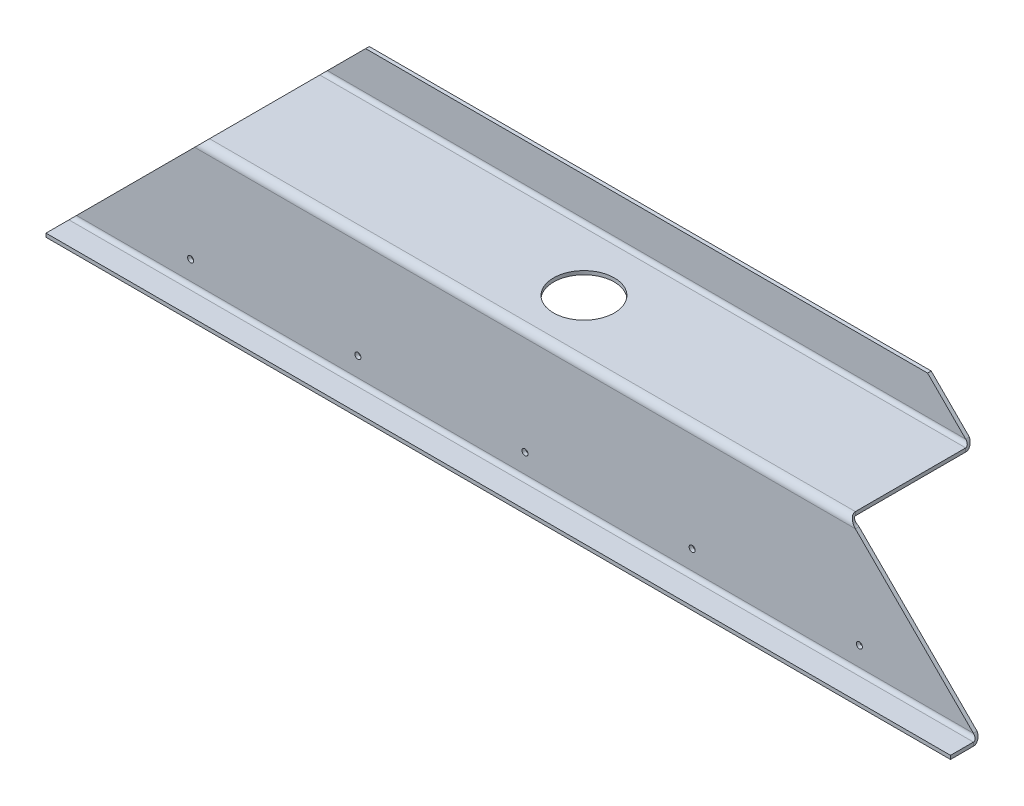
ISO-10303-21;
HEADER;
FILE_DESCRIPTION(('STEP AP214'),'2;1');
FILE_NAME('part.step','',(''),(''),'','','');
FILE_SCHEMA(('AUTOMOTIVE_DESIGN { 1 0 10303 214 1 1 1 1 }'));
ENDSEC;
DATA;
#1=APPLICATION_CONTEXT('core data for automotive mechanical design processes');
#2=APPLICATION_PROTOCOL_DEFINITION('international standard','automotive_design',2000,#1);
#3=PRODUCT_CONTEXT('',#1,'mechanical');
#4=PRODUCT('Part','Part','',(#3));
#5=PRODUCT_RELATED_PRODUCT_CATEGORY('part','',(#4));
#6=PRODUCT_DEFINITION_FORMATION('','',#4);
#7=PRODUCT_DEFINITION_CONTEXT('part definition',#1,'design');
#8=PRODUCT_DEFINITION('design','',#6,#7);
#9=PRODUCT_DEFINITION_SHAPE('','',#8);
#10=(LENGTH_UNIT() NAMED_UNIT(*) SI_UNIT(.MILLI.,.METRE.));
#11=(NAMED_UNIT(*) PLANE_ANGLE_UNIT() SI_UNIT($,.RADIAN.));
#12=(NAMED_UNIT(*) SI_UNIT($,.STERADIAN.) SOLID_ANGLE_UNIT());
#13=UNCERTAINTY_MEASURE_WITH_UNIT(LENGTH_MEASURE(1.E-05),#10,'distance_accuracy_value','');
#14=(GEOMETRIC_REPRESENTATION_CONTEXT(3) GLOBAL_UNCERTAINTY_ASSIGNED_CONTEXT((#13)) GLOBAL_UNIT_ASSIGNED_CONTEXT((#10,
#11,#12)) REPRESENTATION_CONTEXT('',''));
#15=CARTESIAN_POINT('',(0.,0.,0.));
#16=DIRECTION('',(0.,0.,1.));
#17=DIRECTION('',(1.,0.,0.));
#18=AXIS2_PLACEMENT_3D('',#15,#16,#17);
#19=CARTESIAN_POINT('',(0.,3.60016566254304E-13,104.648));
#20=DIRECTION('',(0.,0.,-1.));
#21=DIRECTION('',(0.,1.,0.));
#22=AXIS2_PLACEMENT_3D('',#19,#20,#21);
#23=PLANE('',#22);
#24=CARTESIAN_POINT('',(101.6,-85.8519999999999,104.648));
#25=DIRECTION('',(0.,0.,1.));
#26=DIRECTION('',(1.,0.,0.));
#27=AXIS2_PLACEMENT_3D('',#24,#25,#26);
#28=CIRCLE('',#27,2.54000000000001);
#29=CARTESIAN_POINT('',(104.14,-85.8519999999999,104.648));
#30=VERTEX_POINT('',#29);
#31=EDGE_CURVE('E862',#30,#30,#28,.T.);
#32=ORIENTED_EDGE('',*,*,#31,.F.);
#33=EDGE_LOOP('',(#32));
#34=FACE_BOUND('',#33,.T.);
#35=CARTESIAN_POINT('',(241.3,-85.8519999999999,104.648));
#36=DIRECTION('',(0.,0.,1.));
#37=DIRECTION('',(1.,0.,0.));
#38=AXIS2_PLACEMENT_3D('',#35,#36,#37);
#39=CIRCLE('',#38,2.54000000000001);
#40=CARTESIAN_POINT('',(243.84,-85.8519999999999,104.648));
#41=VERTEX_POINT('',#40);
#42=EDGE_CURVE('E863',#41,#41,#39,.T.);
#43=ORIENTED_EDGE('',*,*,#42,.F.);
#44=EDGE_LOOP('',(#43));
#45=FACE_BOUND('',#44,.T.);
#46=CARTESIAN_POINT('',(660.4,-85.8519999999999,104.648));
#47=DIRECTION('',(0.,0.,1.));
#48=DIRECTION('',(1.,0.,0.));
#49=AXIS2_PLACEMENT_3D('',#46,#47,#48);
#50=CIRCLE('',#49,2.54000000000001);
#51=CARTESIAN_POINT('',(662.94,-85.8519999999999,104.648));
#52=VERTEX_POINT('',#51);
#53=EDGE_CURVE('E865',#52,#52,#50,.T.);
#54=ORIENTED_EDGE('',*,*,#53,.F.);
#55=EDGE_LOOP('',(#54));
#56=FACE_BOUND('',#55,.T.);
#57=CARTESIAN_POINT('',(520.7,-85.8519999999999,104.648));
#58=DIRECTION('',(0.,0.,1.));
#59=DIRECTION('',(1.,0.,0.));
#60=AXIS2_PLACEMENT_3D('',#57,#58,#59);
#61=CIRCLE('',#60,2.54000000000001);
#62=CARTESIAN_POINT('',(523.24,-85.8519999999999,104.648));
#63=VERTEX_POINT('',#62);
#64=EDGE_CURVE('E280',#63,#63,#61,.T.);
#65=ORIENTED_EDGE('',*,*,#64,.F.);
#66=EDGE_LOOP('',(#65));
#67=FACE_BOUND('',#66,.T.);
#68=CARTESIAN_POINT('',(381.,-85.8519999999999,104.648));
#69=DIRECTION('',(0.,0.,1.));
#70=DIRECTION('',(1.,0.,0.));
#71=AXIS2_PLACEMENT_3D('',#68,#69,#70);
#72=CIRCLE('',#71,2.54000000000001);
#73=CARTESIAN_POINT('',(383.54,-85.8519999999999,104.648));
#74=VERTEX_POINT('',#73);
#75=EDGE_CURVE('E275',#74,#74,#72,.T.);
#76=ORIENTED_EDGE('',*,*,#75,.F.);
#77=EDGE_LOOP('',(#76));
#78=FACE_BOUND('',#77,.T.);
#79=DIRECTION('',(-0.707106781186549,0.707106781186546,0.));
#80=VECTOR('',#79,1.);
#81=CARTESIAN_POINT('',(326.961499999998,326.9615,104.647999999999));
#82=LINE('',#81,#80);
#83=CARTESIAN_POINT('',(755.777,-101.854,104.648));
#84=VERTEX_POINT('',#83);
#85=CARTESIAN_POINT('',(657.098,-3.17500000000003,104.648));
#86=VERTEX_POINT('',#85);
#87=EDGE_CURVE('E226',#84,#86,#82,.T.);
#88=ORIENTED_EDGE('',*,*,#87,.T.);
#89=DIRECTION('',(-1.,0.,0.));
#90=VECTOR('',#89,1.);
#91=CARTESIAN_POINT('',(762.,-3.175,104.648));
#92=LINE('',#91,#90);
#93=CARTESIAN_POINT('',(104.901999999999,-3.17500000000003,104.648));
#94=VERTEX_POINT('',#93);
#95=EDGE_CURVE('E243',#94,#86,#92,.F.);
#96=ORIENTED_EDGE('',*,*,#95,.F.);
#97=DIRECTION('',(0.707106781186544,0.707106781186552,0.));
#98=VECTOR('',#97,1.);
#99=CARTESIAN_POINT('',(54.0385000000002,-54.0384999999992,104.648));
#100=LINE('',#99,#98);
#101=CARTESIAN_POINT('',(6.22299999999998,-101.854,104.648));
#102=VERTEX_POINT('',#101);
#103=EDGE_CURVE('E356',#102,#94,#100,.T.);
#104=ORIENTED_EDGE('',*,*,#103,.F.);
#105=DIRECTION('',(1.,0.,0.));
#106=VECTOR('',#105,1.);
#107=CARTESIAN_POINT('',(762.,-101.854,104.648));
#108=LINE('',#107,#106);
#109=EDGE_CURVE('E248',#84,#102,#108,.F.);
#110=ORIENTED_EDGE('',*,*,#109,.F.);
#111=EDGE_LOOP('',(#88,#96,#104,#110));
#112=FACE_BOUND('',#111,.T.);
#113=ADVANCED_FACE('F88',(#34,#45,#56,#67,#78,#112),#23,.F.);
#114=CARTESIAN_POINT('',(0.,3.49778738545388E-13,101.6));
#115=DIRECTION('',(0.,0.,-1.));
#116=DIRECTION('',(0.,1.,0.));
#117=AXIS2_PLACEMENT_3D('',#114,#115,#116);
#118=PLANE('',#117);
#119=CARTESIAN_POINT('',(101.6,-85.8519999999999,101.6));
#120=DIRECTION('',(0.,0.,-1.));
#121=DIRECTION('',(0.,1.,0.));
#122=AXIS2_PLACEMENT_3D('',#119,#120,#121);
#123=CIRCLE('',#122,2.54000000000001);
#124=CARTESIAN_POINT('',(101.6,-83.3119999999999,101.6));
#125=VERTEX_POINT('',#124);
#126=EDGE_CURVE('E92',#125,#125,#123,.T.);
#127=ORIENTED_EDGE('',*,*,#126,.F.);
#128=EDGE_LOOP('',(#127));
#129=FACE_BOUND('',#128,.T.);
#130=CARTESIAN_POINT('',(241.3,-85.8519999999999,101.6));
#131=DIRECTION('',(0.,0.,-1.));
#132=DIRECTION('',(0.,1.,0.));
#133=AXIS2_PLACEMENT_3D('',#130,#131,#132);
#134=CIRCLE('',#133,2.54000000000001);
#135=CARTESIAN_POINT('',(241.3,-83.3119999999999,101.6));
#136=VERTEX_POINT('',#135);
#137=EDGE_CURVE('E282',#136,#136,#134,.T.);
#138=ORIENTED_EDGE('',*,*,#137,.F.);
#139=EDGE_LOOP('',(#138));
#140=FACE_BOUND('',#139,.T.);
#141=CARTESIAN_POINT('',(660.4,-85.8519999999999,101.6));
#142=DIRECTION('',(0.,0.,-1.));
#143=DIRECTION('',(0.,1.,0.));
#144=AXIS2_PLACEMENT_3D('',#141,#142,#143);
#145=CIRCLE('',#144,2.54000000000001);
#146=CARTESIAN_POINT('',(660.4,-83.3119999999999,101.6));
#147=VERTEX_POINT('',#146);
#148=EDGE_CURVE('E279',#147,#147,#145,.T.);
#149=ORIENTED_EDGE('',*,*,#148,.F.);
#150=EDGE_LOOP('',(#149));
#151=FACE_BOUND('',#150,.T.);
#152=CARTESIAN_POINT('',(520.7,-85.8519999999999,101.6));
#153=DIRECTION('',(0.,0.,-1.));
#154=DIRECTION('',(0.,1.,0.));
#155=AXIS2_PLACEMENT_3D('',#152,#153,#154);
#156=CIRCLE('',#155,2.54000000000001);
#157=CARTESIAN_POINT('',(520.7,-83.3119999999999,101.6));
#158=VERTEX_POINT('',#157);
#159=EDGE_CURVE('E276',#158,#158,#156,.T.);
#160=ORIENTED_EDGE('',*,*,#159,.F.);
#161=EDGE_LOOP('',(#160));
#162=FACE_BOUND('',#161,.T.);
#163=CARTESIAN_POINT('',(381.,-85.8519999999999,101.6));
#164=DIRECTION('',(0.,0.,-1.));
#165=DIRECTION('',(0.,1.,0.));
#166=AXIS2_PLACEMENT_3D('',#163,#164,#165);
#167=CIRCLE('',#166,2.54000000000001);
#168=CARTESIAN_POINT('',(381.,-83.3119999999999,101.6));
#169=VERTEX_POINT('',#168);
#170=EDGE_CURVE('E271',#169,#169,#167,.T.);
#171=ORIENTED_EDGE('',*,*,#170,.F.);
#172=EDGE_LOOP('',(#171));
#173=FACE_BOUND('',#172,.T.);
#174=DIRECTION('',(-1.,0.,0.));
#175=VECTOR('',#174,1.);
#176=CARTESIAN_POINT('',(762.,-3.175,101.6));
#177=LINE('',#176,#175);
#178=CARTESIAN_POINT('',(657.098,-3.17500000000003,101.6));
#179=VERTEX_POINT('',#178);
#180=CARTESIAN_POINT('',(104.901999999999,-3.17500000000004,101.6));
#181=VERTEX_POINT('',#180);
#182=EDGE_CURVE('E233',#179,#181,#177,.T.);
#183=ORIENTED_EDGE('',*,*,#182,.F.);
#184=DIRECTION('',(-0.707106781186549,0.707106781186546,0.));
#185=VECTOR('',#184,1.);
#186=CARTESIAN_POINT('',(326.961499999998,326.9615,101.599999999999));
#187=LINE('',#186,#185);
#188=CARTESIAN_POINT('',(755.777,-101.854,101.6));
#189=VERTEX_POINT('',#188);
#190=EDGE_CURVE('E219',#189,#179,#187,.T.);
#191=ORIENTED_EDGE('',*,*,#190,.F.);
#192=DIRECTION('',(1.,0.,0.));
#193=VECTOR('',#192,1.);
#194=CARTESIAN_POINT('',(762.,-101.854,101.6));
#195=LINE('',#194,#193);
#196=CARTESIAN_POINT('',(6.22299999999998,-101.854,101.6));
#197=VERTEX_POINT('',#196);
#198=EDGE_CURVE('E244',#189,#197,#195,.F.);
#199=ORIENTED_EDGE('',*,*,#198,.T.);
#200=DIRECTION('',(0.707106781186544,0.707106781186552,0.));
#201=VECTOR('',#200,1.);
#202=CARTESIAN_POINT('',(54.0385000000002,-54.0384999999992,101.6));
#203=LINE('',#202,#201);
#204=EDGE_CURVE('E242',#197,#181,#203,.T.);
#205=ORIENTED_EDGE('',*,*,#204,.T.);
#206=EDGE_LOOP('',(#183,#191,#199,#205));
#207=FACE_BOUND('',#206,.T.);
#208=ADVANCED_FACE('F240',(#129,#140,#151,#162,#173,#207),#118,.T.);
#209=CARTESIAN_POINT('',(873.36792134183,3.048,0.));
#210=DIRECTION('',(0.,-1.,0.));
#211=DIRECTION('',(0.,0.,-1.));
#212=AXIS2_PLACEMENT_3D('',#209,#210,#211);
#213=PLANE('',#212);
#214=CARTESIAN_POINT('',(381.,3.048,55.372));
#215=DIRECTION('',(0.,-1.,0.));
#216=DIRECTION('',(0.,0.,-1.));
#217=AXIS2_PLACEMENT_3D('',#214,#215,#216);
#218=CIRCLE('',#217,25.4);
#219=CARTESIAN_POINT('',(381.,3.048,29.972));
#220=VERTEX_POINT('',#219);
#221=EDGE_CURVE('E259',#220,#220,#218,.T.);
#222=ORIENTED_EDGE('',*,*,#221,.T.);
#223=EDGE_LOOP('',(#222));
#224=FACE_BOUND('',#223,.T.);
#225=DIRECTION('',(0.,0.,-1.));
#226=VECTOR('',#225,1.);
#227=CARTESIAN_POINT('',(650.875,3.048,0.));
#228=LINE('',#227,#226);
#229=CARTESIAN_POINT('',(650.875,3.04799999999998,98.425));
#230=VERTEX_POINT('',#229);
#231=CARTESIAN_POINT('',(650.875,3.048,6.223));
#232=VERTEX_POINT('',#231);
#233=EDGE_CURVE('E215',#230,#232,#228,.T.);
#234=ORIENTED_EDGE('',*,*,#233,.T.);
#235=DIRECTION('',(-1.,0.,0.));
#236=VECTOR('',#235,1.);
#237=CARTESIAN_POINT('',(873.36792134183,3.048,6.223));
#238=LINE('',#237,#236);
#239=CARTESIAN_POINT('',(111.124999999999,3.048,6.223));
#240=VERTEX_POINT('',#239);
#241=EDGE_CURVE('E262',#232,#240,#238,.T.);
#242=ORIENTED_EDGE('',*,*,#241,.T.);
#243=DIRECTION('',(0.,0.,-1.));
#244=VECTOR('',#243,1.);
#245=CARTESIAN_POINT('',(111.124999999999,3.048,-1.00679860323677E-13));
#246=LINE('',#245,#244);
#247=CARTESIAN_POINT('',(111.124999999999,3.04799999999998,98.425));
#248=VERTEX_POINT('',#247);
#249=EDGE_CURVE('E367',#248,#240,#246,.T.);
#250=ORIENTED_EDGE('',*,*,#249,.F.);
#251=DIRECTION('',(-1.,0.,0.));
#252=VECTOR('',#251,1.);
#253=CARTESIAN_POINT('',(0.,3.04799999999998,98.425));
#254=LINE('',#253,#252);
#255=EDGE_CURVE('E252',#248,#230,#254,.F.);
#256=ORIENTED_EDGE('',*,*,#255,.T.);
#257=EDGE_LOOP('',(#234,#242,#250,#256));
#258=FACE_BOUND('',#257,.T.);
#259=ADVANCED_FACE('F90',(#224,#258),#213,.F.);
#260=CARTESIAN_POINT('',(873.36792134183,0.,0.));
#261=DIRECTION('',(0.,-1.,0.));
#262=DIRECTION('',(0.,0.,-1.));
#263=AXIS2_PLACEMENT_3D('',#260,#261,#262);
#264=PLANE('',#263);
#265=CARTESIAN_POINT('',(381.,0.,55.372));
#266=DIRECTION('',(0.,-1.,0.));
#267=DIRECTION('',(0.,0.,-1.));
#268=AXIS2_PLACEMENT_3D('',#265,#266,#267);
#269=CIRCLE('',#268,25.4);
#270=CARTESIAN_POINT('',(381.,0.,29.972));
#271=VERTEX_POINT('',#270);
#272=EDGE_CURVE('E255',#271,#271,#269,.T.);
#273=ORIENTED_EDGE('',*,*,#272,.F.);
#274=EDGE_LOOP('',(#273));
#275=FACE_BOUND('',#274,.T.);
#276=DIRECTION('',(-1.,0.,0.));
#277=VECTOR('',#276,1.);
#278=CARTESIAN_POINT('',(873.36792134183,0.,6.223));
#279=LINE('',#278,#277);
#280=CARTESIAN_POINT('',(650.875,0.,6.223));
#281=VERTEX_POINT('',#280);
#282=CARTESIAN_POINT('',(111.124999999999,0.,6.223));
#283=VERTEX_POINT('',#282);
#284=EDGE_CURVE('E13',#281,#283,#279,.T.);
#285=ORIENTED_EDGE('',*,*,#284,.F.);
#286=DIRECTION('',(0.,0.,-1.));
#287=VECTOR('',#286,1.);
#288=CARTESIAN_POINT('',(650.875,0.,0.));
#289=LINE('',#288,#287);
#290=CARTESIAN_POINT('',(650.875,0.,98.425));
#291=VERTEX_POINT('',#290);
#292=EDGE_CURVE('E325',#291,#281,#289,.T.);
#293=ORIENTED_EDGE('',*,*,#292,.F.);
#294=DIRECTION('',(-1.,0.,0.));
#295=VECTOR('',#294,1.);
#296=CARTESIAN_POINT('',(0.,0.,98.425));
#297=LINE('',#296,#295);
#298=CARTESIAN_POINT('',(111.124999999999,0.,98.425));
#299=VERTEX_POINT('',#298);
#300=EDGE_CURVE('E236',#299,#291,#297,.F.);
#301=ORIENTED_EDGE('',*,*,#300,.F.);
#302=DIRECTION('',(0.,0.,-1.));
#303=VECTOR('',#302,1.);
#304=CARTESIAN_POINT('',(111.124999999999,0.,0.));
#305=LINE('',#304,#303);
#306=EDGE_CURVE('E363',#299,#283,#305,.T.);
#307=ORIENTED_EDGE('',*,*,#306,.T.);
#308=EDGE_LOOP('',(#285,#293,#301,#307));
#309=FACE_BOUND('',#308,.T.);
#310=ADVANCED_FACE('F460',(#275,#309),#264,.T.);
#311=CARTESIAN_POINT('',(873.36792134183,6.223,6.223));
#312=DIRECTION('',(-1.,0.,0.));
#313=DIRECTION('',(0.,0.,1.));
#314=AXIS2_PLACEMENT_3D('',#311,#312,#313);
#315=CYLINDRICAL_SURFACE('',#314,6.223);
#316=DIRECTION('',(-1.,0.,0.));
#317=VECTOR('',#316,1.);
#318=CARTESIAN_POINT('',(873.36792134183,6.22299999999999,0.));
#319=LINE('',#318,#317);
#320=CARTESIAN_POINT('',(647.7,6.22299999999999,0.));
#321=VERTEX_POINT('',#320);
#322=CARTESIAN_POINT('',(114.299999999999,6.22299999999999,0.));
#323=VERTEX_POINT('',#322);
#324=EDGE_CURVE('E97',#321,#323,#319,.T.);
#325=ORIENTED_EDGE('',*,*,#324,.F.);
#326=CARTESIAN_POINT('',(647.7,6.223,6.223));
#327=DIRECTION('',(-0.890761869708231,-0.454470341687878,0.));
#328=DIRECTION('',(-0.454470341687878,0.890761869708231,0.));
#329=AXIS2_PLACEMENT_3D('',#326,#327,#328);
#330=ELLIPSE('',#329,6.98615445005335,6.223);
#331=EDGE_CURVE('E311',#281,#321,#330,.F.);
#332=ORIENTED_EDGE('',*,*,#331,.F.);
#333=ORIENTED_EDGE('',*,*,#284,.T.);
#334=CARTESIAN_POINT('',(114.299999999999,6.223,6.223));
#335=DIRECTION('',(-0.890761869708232,0.454470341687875,0.));
#336=DIRECTION('',(-0.454470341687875,-0.890761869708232,0.));
#337=AXIS2_PLACEMENT_3D('',#334,#335,#336);
#338=ELLIPSE('',#337,6.98615445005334,6.223);
#339=EDGE_CURVE('E352',#283,#323,#338,.F.);
#340=ORIENTED_EDGE('',*,*,#339,.T.);
#341=EDGE_LOOP('',(#325,#332,#333,#340));
#342=FACE_BOUND('',#341,.T.);
#343=ADVANCED_FACE('F455',(#342),#315,.T.);
#344=CARTESIAN_POINT('',(873.36792134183,0.,0.));
#345=DIRECTION('',(0.,0.,-1.));
#346=DIRECTION('',(-1.,0.,0.));
#347=AXIS2_PLACEMENT_3D('',#344,#345,#346);
#348=PLANE('',#347);
#349=DIRECTION('',(-1.,0.,0.));
#350=VECTOR('',#349,1.);
#351=CARTESIAN_POINT('',(873.36792134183,38.1,0.));
#352=LINE('',#351,#350);
#353=CARTESIAN_POINT('',(615.822999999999,38.1,0.));
#354=VERTEX_POINT('',#353);
#355=CARTESIAN_POINT('',(146.176999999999,38.1,0.));
#356=VERTEX_POINT('',#355);
#357=EDGE_CURVE('E268',#354,#356,#352,.T.);
#358=ORIENTED_EDGE('',*,*,#357,.F.);
#359=DIRECTION('',(-0.707106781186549,0.707106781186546,0.));
#360=VECTOR('',#359,1.);
#361=CARTESIAN_POINT('',(763.645460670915,-109.722460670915,0.));
#362=LINE('',#361,#360);
#363=EDGE_CURVE('E316',#321,#354,#362,.T.);
#364=ORIENTED_EDGE('',*,*,#363,.F.);
#365=ORIENTED_EDGE('',*,*,#324,.T.);
#366=DIRECTION('',(0.707106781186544,0.707106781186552,0.));
#367=VECTOR('',#366,1.);
#368=CARTESIAN_POINT('',(490.72246067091,382.645460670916,0.));
#369=LINE('',#368,#367);
#370=EDGE_CURVE('E374',#323,#356,#369,.T.);
#371=ORIENTED_EDGE('',*,*,#370,.T.);
#372=EDGE_LOOP('',(#358,#364,#365,#371));
#373=FACE_BOUND('',#372,.T.);
#374=ADVANCED_FACE('F452',(#373),#348,.T.);
#375=CARTESIAN_POINT('',(873.36792134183,38.1,3.048));
#376=DIRECTION('',(0.,1.,0.));
#377=DIRECTION('',(0.,0.,1.));
#378=AXIS2_PLACEMENT_3D('',#375,#376,#377);
#379=PLANE('',#378);
#380=DIRECTION('',(-1.,0.,0.));
#381=VECTOR('',#380,1.);
#382=CARTESIAN_POINT('',(873.36792134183,38.1,3.048));
#383=LINE('',#382,#381);
#384=CARTESIAN_POINT('',(615.822999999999,38.1,3.04799999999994));
#385=VERTEX_POINT('',#384);
#386=CARTESIAN_POINT('',(146.176999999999,38.1,3.048));
#387=VERTEX_POINT('',#386);
#388=EDGE_CURVE('E266',#385,#387,#383,.T.);
#389=ORIENTED_EDGE('',*,*,#388,.F.);
#390=DIRECTION('',(0.,0.,1.));
#391=VECTOR('',#390,1.);
#392=CARTESIAN_POINT('',(615.822999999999,38.1,3.04799999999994));
#393=LINE('',#392,#391);
#394=EDGE_CURVE('E307',#385,#354,#393,.F.);
#395=ORIENTED_EDGE('',*,*,#394,.T.);
#396=ORIENTED_EDGE('',*,*,#357,.T.);
#397=DIRECTION('',(0.,0.,-1.));
#398=VECTOR('',#397,1.);
#399=CARTESIAN_POINT('',(146.176999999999,38.1,0.));
#400=LINE('',#399,#398);
#401=EDGE_CURVE('E391',#356,#387,#400,.F.);
#402=ORIENTED_EDGE('',*,*,#401,.T.);
#403=EDGE_LOOP('',(#389,#395,#396,#402));
#404=FACE_BOUND('',#403,.T.);
#405=ADVANCED_FACE('F448',(#404),#379,.T.);
#406=CARTESIAN_POINT('',(873.36792134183,0.,3.048));
#407=DIRECTION('',(0.,0.,-1.));
#408=DIRECTION('',(-1.,0.,0.));
#409=AXIS2_PLACEMENT_3D('',#406,#407,#408);
#410=PLANE('',#409);
#411=DIRECTION('',(-0.707106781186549,0.707106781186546,0.));
#412=VECTOR('',#411,1.);
#413=CARTESIAN_POINT('',(763.645460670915,-109.722460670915,3.048));
#414=LINE('',#413,#412);
#415=CARTESIAN_POINT('',(647.7,6.22299999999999,3.048));
#416=VERTEX_POINT('',#415);
#417=EDGE_CURVE('E313',#416,#385,#414,.T.);
#418=ORIENTED_EDGE('',*,*,#417,.T.);
#419=ORIENTED_EDGE('',*,*,#388,.T.);
#420=DIRECTION('',(0.707106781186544,0.707106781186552,0.));
#421=VECTOR('',#420,1.);
#422=CARTESIAN_POINT('',(490.72246067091,382.645460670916,3.048));
#423=LINE('',#422,#421);
#424=CARTESIAN_POINT('',(114.299999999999,6.22299999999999,3.048));
#425=VERTEX_POINT('',#424);
#426=EDGE_CURVE('E385',#425,#387,#423,.T.);
#427=ORIENTED_EDGE('',*,*,#426,.F.);
#428=DIRECTION('',(-1.,0.,0.));
#429=VECTOR('',#428,1.);
#430=CARTESIAN_POINT('',(873.36792134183,6.22299999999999,3.048));
#431=LINE('',#430,#429);
#432=EDGE_CURVE('E264',#416,#425,#431,.T.);
#433=ORIENTED_EDGE('',*,*,#432,.F.);
#434=EDGE_LOOP('',(#418,#419,#427,#433));
#435=FACE_BOUND('',#434,.T.);
#436=ADVANCED_FACE('F440',(#435),#410,.F.);
#437=CARTESIAN_POINT('',(873.36792134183,6.223,6.223));
#438=DIRECTION('',(-1.,0.,0.));
#439=DIRECTION('',(0.,0.,1.));
#440=AXIS2_PLACEMENT_3D('',#437,#438,#439);
#441=CYLINDRICAL_SURFACE('',#440,3.175);
#442=CARTESIAN_POINT('',(647.7,6.223,6.223));
#443=DIRECTION('',(-0.707106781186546,-0.707106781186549,0.));
#444=DIRECTION('',(-0.707106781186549,0.707106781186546,0.));
#445=AXIS2_PLACEMENT_3D('',#442,#443,#444);
#446=ELLIPSE('',#445,4.49012806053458,3.175);
#447=EDGE_CURVE('E237',#232,#416,#446,.F.);
#448=ORIENTED_EDGE('',*,*,#447,.T.);
#449=ORIENTED_EDGE('',*,*,#432,.T.);
#450=CARTESIAN_POINT('',(114.299999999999,6.223,6.223));
#451=DIRECTION('',(-0.707106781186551,0.707106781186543,0.));
#452=DIRECTION('',(-0.707106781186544,-0.707106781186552,0.));
#453=AXIS2_PLACEMENT_3D('',#450,#451,#452);
#454=ELLIPSE('',#453,4.49012806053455,3.175);
#455=EDGE_CURVE('E337',#240,#425,#454,.F.);
#456=ORIENTED_EDGE('',*,*,#455,.F.);
#457=ORIENTED_EDGE('',*,*,#241,.F.);
#458=EDGE_LOOP('',(#448,#449,#456,#457));
#459=FACE_BOUND('',#458,.T.);
#460=ADVANCED_FACE('F436',(#459),#441,.F.);
#461=CARTESIAN_POINT('',(0.,-3.17500000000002,98.425));
#462=DIRECTION('',(-1.,0.,0.));
#463=DIRECTION('',(0.,0.,1.));
#464=AXIS2_PLACEMENT_3D('',#461,#462,#463);
#465=CYLINDRICAL_SURFACE('',#464,6.223);
#466=ORIENTED_EDGE('',*,*,#95,.T.);
#467=CARTESIAN_POINT('',(657.098,-3.17500000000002,98.425));
#468=DIRECTION('',(-0.707106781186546,-0.707106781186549,0.));
#469=DIRECTION('',(-0.707106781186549,0.707106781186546,0.));
#470=AXIS2_PLACEMENT_3D('',#467,#468,#469);
#471=ELLIPSE('',#470,8.80065099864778,6.223);
#472=EDGE_CURVE('E212',#230,#86,#471,.F.);
#473=ORIENTED_EDGE('',*,*,#472,.F.);
#474=ORIENTED_EDGE('',*,*,#255,.F.);
#475=CARTESIAN_POINT('',(104.901999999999,-3.17500000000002,98.425));
#476=DIRECTION('',(-0.707106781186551,0.707106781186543,0.));
#477=DIRECTION('',(-0.707106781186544,-0.707106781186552,0.));
#478=AXIS2_PLACEMENT_3D('',#475,#476,#477);
#479=ELLIPSE('',#478,8.80065099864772,6.223);
#480=EDGE_CURVE('E338',#248,#94,#479,.F.);
#481=ORIENTED_EDGE('',*,*,#480,.T.);
#482=EDGE_LOOP('',(#466,#473,#474,#481));
#483=FACE_BOUND('',#482,.T.);
#484=ADVANCED_FACE('F419',(#483),#465,.T.);
#485=CARTESIAN_POINT('',(0.,-3.17500000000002,98.425));
#486=DIRECTION('',(-1.,0.,0.));
#487=DIRECTION('',(0.,0.,1.));
#488=AXIS2_PLACEMENT_3D('',#485,#486,#487);
#489=CYLINDRICAL_SURFACE('',#488,3.175);
#490=CARTESIAN_POINT('',(657.098,-3.17500000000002,98.425));
#491=DIRECTION('',(-0.454470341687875,-0.890761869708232,0.));
#492=DIRECTION('',(-0.890761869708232,0.454470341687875,0.));
#493=AXIS2_PLACEMENT_3D('',#490,#491,#492);
#494=ELLIPSE('',#493,6.98615445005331,3.175);
#495=EDGE_CURVE('E209',#291,#179,#494,.F.);
#496=ORIENTED_EDGE('',*,*,#495,.T.);
#497=ORIENTED_EDGE('',*,*,#182,.T.);
#498=CARTESIAN_POINT('',(104.901999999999,-3.17500000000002,98.425));
#499=DIRECTION('',(-0.454470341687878,0.890761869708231,0.));
#500=DIRECTION('',(-0.890761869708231,-0.454470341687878,0.));
#501=AXIS2_PLACEMENT_3D('',#498,#499,#500);
#502=ELLIPSE('',#501,6.98615445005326,3.175);
#503=EDGE_CURVE('E335',#299,#181,#502,.F.);
#504=ORIENTED_EDGE('',*,*,#503,.F.);
#505=ORIENTED_EDGE('',*,*,#300,.T.);
#506=EDGE_LOOP('',(#496,#497,#504,#505));
#507=FACE_BOUND('',#506,.T.);
#508=ADVANCED_FACE('F231',(#507),#489,.F.);
#509=CARTESIAN_POINT('',(762.,-101.854,107.823));
#510=DIRECTION('',(1.,0.,0.));
#511=DIRECTION('',(0.,-1.,0.));
#512=AXIS2_PLACEMENT_3D('',#509,#510,#511);
#513=CYLINDRICAL_SURFACE('',#512,6.223);
#514=ORIENTED_EDGE('',*,*,#198,.F.);
#515=CARTESIAN_POINT('',(755.777,-101.854,107.823));
#516=DIRECTION('',(-0.890761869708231,-0.454470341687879,0.));
#517=DIRECTION('',(0.454470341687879,-0.890761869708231,0.));
#518=AXIS2_PLACEMENT_3D('',#515,#516,#517);
#519=ELLIPSE('',#518,6.98615445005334,6.223);
#520=CARTESIAN_POINT('',(758.952,-108.077,107.823));
#521=VERTEX_POINT('',#520);
#522=EDGE_CURVE('E297',#521,#189,#519,.F.);
#523=ORIENTED_EDGE('',*,*,#522,.F.);
#524=DIRECTION('',(1.,0.,0.));
#525=VECTOR('',#524,1.);
#526=CARTESIAN_POINT('',(0.,-108.077,107.823));
#527=LINE('',#526,#525);
#528=CARTESIAN_POINT('',(3.04799999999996,-108.077,107.823));
#529=VERTEX_POINT('',#528);
#530=EDGE_CURVE('E400',#521,#529,#527,.F.);
#531=ORIENTED_EDGE('',*,*,#530,.T.);
#532=CARTESIAN_POINT('',(6.22299999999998,-101.854,107.823));
#533=DIRECTION('',(-0.890761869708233,0.454470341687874,0.));
#534=DIRECTION('',(0.454470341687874,0.890761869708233,0.));
#535=AXIS2_PLACEMENT_3D('',#532,#533,#534);
#536=ELLIPSE('',#535,6.98615445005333,6.223);
#537=EDGE_CURVE('E341',#529,#197,#536,.F.);
#538=ORIENTED_EDGE('',*,*,#537,.T.);
#539=EDGE_LOOP('',(#514,#523,#531,#538));
#540=FACE_BOUND('',#539,.T.);
#541=ADVANCED_FACE('F496',(#540),#513,.T.);
#542=CARTESIAN_POINT('',(762.,-101.854,107.823));
#543=DIRECTION('',(1.,0.,0.));
#544=DIRECTION('',(0.,-1.,0.));
#545=AXIS2_PLACEMENT_3D('',#542,#543,#544);
#546=CYLINDRICAL_SURFACE('',#545,3.175);
#547=CARTESIAN_POINT('',(755.777,-101.854,107.823));
#548=DIRECTION('',(-0.707106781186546,-0.707106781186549,0.));
#549=DIRECTION('',(0.707106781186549,-0.707106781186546,0.));
#550=AXIS2_PLACEMENT_3D('',#547,#548,#549);
#551=ELLIPSE('',#550,4.49012806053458,3.175);
#552=CARTESIAN_POINT('',(758.952,-105.029,107.823));
#553=VERTEX_POINT('',#552);
#554=EDGE_CURVE('E274',#553,#84,#551,.F.);
#555=ORIENTED_EDGE('',*,*,#554,.T.);
#556=ORIENTED_EDGE('',*,*,#109,.T.);
#557=CARTESIAN_POINT('',(6.22299999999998,-101.854,107.823));
#558=DIRECTION('',(-0.707106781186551,0.707106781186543,0.));
#559=DIRECTION('',(0.707106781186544,0.707106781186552,0.));
#560=AXIS2_PLACEMENT_3D('',#557,#558,#559);
#561=ELLIPSE('',#560,4.49012806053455,3.175);
#562=CARTESIAN_POINT('',(3.04799999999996,-105.029,107.823));
#563=VERTEX_POINT('',#562);
#564=EDGE_CURVE('E333',#563,#102,#561,.F.);
#565=ORIENTED_EDGE('',*,*,#564,.F.);
#566=DIRECTION('',(1.,0.,0.));
#567=VECTOR('',#566,1.);
#568=CARTESIAN_POINT('',(0.,-105.029,107.823));
#569=LINE('',#568,#567);
#570=EDGE_CURVE('E394',#563,#553,#569,.T.);
#571=ORIENTED_EDGE('',*,*,#570,.T.);
#572=EDGE_LOOP('',(#555,#556,#565,#571));
#573=FACE_BOUND('',#572,.T.);
#574=ADVANCED_FACE('F406',(#573),#546,.F.);
#575=CARTESIAN_POINT('',(0.,-108.077,0.));
#576=DIRECTION('',(0.,1.,0.));
#577=DIRECTION('',(0.,0.,1.));
#578=AXIS2_PLACEMENT_3D('',#575,#576,#577);
#579=PLANE('',#578);
#580=DIRECTION('',(0.,0.,1.));
#581=VECTOR('',#580,1.);
#582=CARTESIAN_POINT('',(758.952,-108.077,0.));
#583=LINE('',#582,#581);
#584=CARTESIAN_POINT('',(758.952,-108.077,127.));
#585=VERTEX_POINT('',#584);
#586=EDGE_CURVE('E303',#521,#585,#583,.T.);
#587=ORIENTED_EDGE('',*,*,#586,.T.);
#588=DIRECTION('',(-1.,0.,0.));
#589=VECTOR('',#588,1.);
#590=CARTESIAN_POINT('',(0.,-108.077,127.));
#591=LINE('',#590,#589);
#592=CARTESIAN_POINT('',(3.04799999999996,-108.077,127.));
#593=VERTEX_POINT('',#592);
#594=EDGE_CURVE('E113',#585,#593,#591,.T.);
#595=ORIENTED_EDGE('',*,*,#594,.T.);
#596=DIRECTION('',(0.,0.,1.));
#597=VECTOR('',#596,1.);
#598=CARTESIAN_POINT('',(3.04799999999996,-108.077,0.));
#599=LINE('',#598,#597);
#600=EDGE_CURVE('E346',#529,#593,#599,.T.);
#601=ORIENTED_EDGE('',*,*,#600,.F.);
#602=ORIENTED_EDGE('',*,*,#530,.F.);
#603=EDGE_LOOP('',(#587,#595,#601,#602));
#604=FACE_BOUND('',#603,.T.);
#605=ADVANCED_FACE('F622',(#604),#579,.F.);
#606=CARTESIAN_POINT('',(0.,-105.029,0.));
#607=DIRECTION('',(0.,1.,0.));
#608=DIRECTION('',(0.,0.,1.));
#609=AXIS2_PLACEMENT_3D('',#606,#607,#608);
#610=PLANE('',#609);
#611=DIRECTION('',(1.,0.,0.));
#612=VECTOR('',#611,1.);
#613=CARTESIAN_POINT('',(0.,-105.029,127.));
#614=LINE('',#613,#612);
#615=CARTESIAN_POINT('',(758.952,-105.029,127.));
#616=VERTEX_POINT('',#615);
#617=CARTESIAN_POINT('',(3.04799999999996,-105.029,127.));
#618=VERTEX_POINT('',#617);
#619=EDGE_CURVE('E398',#616,#618,#614,.F.);
#620=ORIENTED_EDGE('',*,*,#619,.F.);
#621=DIRECTION('',(0.,0.,1.));
#622=VECTOR('',#621,1.);
#623=CARTESIAN_POINT('',(758.952,-105.029,0.));
#624=LINE('',#623,#622);
#625=EDGE_CURVE('E105',#553,#616,#624,.T.);
#626=ORIENTED_EDGE('',*,*,#625,.F.);
#627=ORIENTED_EDGE('',*,*,#570,.F.);
#628=DIRECTION('',(0.,0.,1.));
#629=VECTOR('',#628,1.);
#630=CARTESIAN_POINT('',(3.04799999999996,-105.029,0.));
#631=LINE('',#630,#629);
#632=EDGE_CURVE('E349',#563,#618,#631,.T.);
#633=ORIENTED_EDGE('',*,*,#632,.T.);
#634=EDGE_LOOP('',(#620,#626,#627,#633));
#635=FACE_BOUND('',#634,.T.);
#636=ADVANCED_FACE('F611',(#635),#610,.T.);
#637=CARTESIAN_POINT('',(0.,-108.077,127.));
#638=DIRECTION('',(0.,0.,-1.));
#639=DIRECTION('',(0.,1.,0.));
#640=AXIS2_PLACEMENT_3D('',#637,#638,#639);
#641=PLANE('',#640);
#642=DIRECTION('',(0.,1.,0.));
#643=VECTOR('',#642,1.);
#644=CARTESIAN_POINT('',(758.952,-105.029,127.));
#645=LINE('',#644,#643);
#646=EDGE_CURVE('E227',#616,#585,#645,.F.);
#647=ORIENTED_EDGE('',*,*,#646,.F.);
#648=ORIENTED_EDGE('',*,*,#619,.T.);
#649=DIRECTION('',(0.,1.,0.));
#650=VECTOR('',#649,1.);
#651=CARTESIAN_POINT('',(3.04799999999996,-105.029,127.));
#652=LINE('',#651,#650);
#653=EDGE_CURVE('E353',#618,#593,#652,.F.);
#654=ORIENTED_EDGE('',*,*,#653,.T.);
#655=ORIENTED_EDGE('',*,*,#594,.F.);
#656=EDGE_LOOP('',(#647,#648,#654,#655));
#657=FACE_BOUND('',#656,.T.);
#658=ADVANCED_FACE('F500',(#657),#641,.F.);
#659=CARTESIAN_POINT('',(381.,38.1,55.372));
#660=DIRECTION('',(0.,-1.,0.));
#661=DIRECTION('',(0.,0.,-1.));
#662=AXIS2_PLACEMENT_3D('',#659,#660,#661);
#663=CYLINDRICAL_SURFACE('',#662,25.4);
#664=ORIENTED_EDGE('',*,*,#272,.T.);
#665=EDGE_LOOP('',(#664));
#666=FACE_BOUND('',#665,.T.);
#667=ORIENTED_EDGE('',*,*,#221,.F.);
#668=EDGE_LOOP('',(#667));
#669=FACE_BOUND('',#668,.T.);
#670=ADVANCED_FACE('F497',(#666,#669),#663,.F.);
#671=CARTESIAN_POINT('',(490.72246067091,382.645460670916,0.));
#672=DIRECTION('',(-0.707106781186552,0.707106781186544,0.));
#673=DIRECTION('',(0.707106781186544,0.707106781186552,0.));
#674=AXIS2_PLACEMENT_3D('',#671,#672,#673);
#675=PLANE('',#674);
#676=ORIENTED_EDGE('',*,*,#401,.F.);
#677=ORIENTED_EDGE('',*,*,#370,.F.);
#678=DIRECTION('',(0.,0.,-1.));
#679=VECTOR('',#678,1.);
#680=CARTESIAN_POINT('',(114.299999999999,6.22299999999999,0.));
#681=LINE('',#680,#679);
#682=EDGE_CURVE('E388',#323,#425,#681,.F.);
#683=ORIENTED_EDGE('',*,*,#682,.T.);
#684=ORIENTED_EDGE('',*,*,#426,.T.);
#685=EDGE_LOOP('',(#676,#677,#683,#684));
#686=FACE_BOUND('',#685,.T.);
#687=ADVANCED_FACE('F445',(#686),#675,.T.);
#688=CARTESIAN_POINT('',(111.124999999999,3.048,-1.00679860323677E-13));
#689=DIRECTION('',(-1.,0.,0.));
#690=DIRECTION('',(0.,0.,-1.));
#691=AXIS2_PLACEMENT_3D('',#688,#689,#690);
#692=PLANE('',#691);
#693=ORIENTED_EDGE('',*,*,#249,.T.);
#694=DIRECTION('',(0.,1.,0.));
#695=VECTOR('',#694,1.);
#696=CARTESIAN_POINT('',(111.124999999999,3.048,6.223));
#697=LINE('',#696,#695);
#698=EDGE_CURVE('E371',#240,#283,#697,.F.);
#699=ORIENTED_EDGE('',*,*,#698,.T.);
#700=ORIENTED_EDGE('',*,*,#306,.F.);
#701=DIRECTION('',(0.,1.,0.));
#702=VECTOR('',#701,1.);
#703=CARTESIAN_POINT('',(111.124999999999,3.04799999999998,98.425));
#704=LINE('',#703,#702);
#705=EDGE_CURVE('E366',#248,#299,#704,.F.);
#706=ORIENTED_EDGE('',*,*,#705,.F.);
#707=EDGE_LOOP('',(#693,#699,#700,#706));
#708=FACE_BOUND('',#707,.T.);
#709=ADVANCED_FACE('F429',(#708),#692,.T.);
#710=CARTESIAN_POINT('',(111.124999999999,0.,6.223));
#711=CARTESIAN_POINT('',(111.124999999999,1.016,6.223));
#712=CARTESIAN_POINT('',(111.124999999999,2.032,6.223));
#713=CARTESIAN_POINT('',(111.124999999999,3.048,6.223));
#714=CARTESIAN_POINT('',(111.124999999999,0.,-6.223));
#715=CARTESIAN_POINT('',(111.124999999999,1.016,-4.191));
#716=CARTESIAN_POINT('',(111.124999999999,2.032,-2.159));
#717=CARTESIAN_POINT('',(111.124999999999,3.048,-0.126999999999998));
#718=CARTESIAN_POINT('',(117.474999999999,12.446,-6.223));
#719=CARTESIAN_POINT('',(117.474999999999,11.43,-4.191));
#720=CARTESIAN_POINT('',(117.474999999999,10.414,-2.159));
#721=CARTESIAN_POINT('',(117.474999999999,9.398,-0.126999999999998));
#722=CARTESIAN_POINT('',(117.474999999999,12.446,6.223));
#723=CARTESIAN_POINT('',(117.474999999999,11.43,6.223));
#724=CARTESIAN_POINT('',(117.474999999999,10.414,6.223));
#725=CARTESIAN_POINT('',(117.474999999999,9.398,6.223));
#726=CARTESIAN_POINT('',(117.474999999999,12.446,18.669));
#727=CARTESIAN_POINT('',(117.474999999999,11.43,16.637));
#728=CARTESIAN_POINT('',(117.474999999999,10.414,14.605));
#729=CARTESIAN_POINT('',(117.474999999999,9.398,12.573));
#730=CARTESIAN_POINT('',(111.124999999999,0.,18.669));
#731=CARTESIAN_POINT('',(111.124999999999,1.016,16.637));
#732=CARTESIAN_POINT('',(111.124999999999,2.032,14.605));
#733=CARTESIAN_POINT('',(111.124999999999,3.048,12.573));
#734=CARTESIAN_POINT('',(111.124999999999,0.,6.223));
#735=CARTESIAN_POINT('',(111.124999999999,1.016,6.223));
#736=CARTESIAN_POINT('',(111.124999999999,2.032,6.223));
#737=CARTESIAN_POINT('',(111.124999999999,3.048,6.223));
#738=(BOUNDED_SURFACE() B_SPLINE_SURFACE(3,3,((#710,#711,#712,#713),(#714,#715,#716,#717),(#718,
#719,#720,#721),(#722,#723,#724,#725),(#726,#727,#728,#729),(#730,#731,#732,#733),(#734,#735,
#736,#737)),.UNSPECIFIED.,.T.,.F.,.F.) B_SPLINE_SURFACE_WITH_KNOTS((4,3,4),(4,4),(0.,0.5,1.),
(0.,1.),.UNSPECIFIED.) GEOMETRIC_REPRESENTATION_ITEM() RATIONAL_B_SPLINE_SURFACE(((1.,1.,1.,1.),
(0.333333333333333,0.333333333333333,0.333333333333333,0.333333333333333),(0.333333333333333,
0.333333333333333,0.333333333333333,0.333333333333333),(1.,1.,1.,1.),(0.333333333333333,
0.333333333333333,0.333333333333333,0.333333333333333),(0.333333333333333,0.333333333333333,
0.333333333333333,0.333333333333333),(1.,1.,1.,1.))) REPRESENTATION_ITEM('') SURFACE());
#739=ORIENTED_EDGE('',*,*,#455,.T.);
#740=ORIENTED_EDGE('',*,*,#682,.F.);
#741=ORIENTED_EDGE('',*,*,#339,.F.);
#742=ORIENTED_EDGE('',*,*,#698,.F.);
#743=EDGE_LOOP('',(#739,#740,#741,#742));
#744=FACE_BOUND('',#743,.T.);
#745=ADVANCED_FACE('F433',(#744),#738,.F.);
#746=CARTESIAN_POINT('',(98.6789999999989,-9.39800000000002,98.425));
#747=CARTESIAN_POINT('',(98.6789999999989,-8.38200000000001,98.425));
#748=CARTESIAN_POINT('',(98.6789999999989,-7.36600000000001,98.425));
#749=CARTESIAN_POINT('',(98.6789999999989,-6.35000000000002,98.425));
#750=CARTESIAN_POINT('',(98.6789999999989,-9.39800000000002,85.979));
#751=CARTESIAN_POINT('',(98.6789999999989,-8.38200000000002,88.0110000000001));
#752=CARTESIAN_POINT('',(98.6789999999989,-7.36600000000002,90.043));
#753=CARTESIAN_POINT('',(98.6789999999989,-6.35000000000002,92.075));
#754=CARTESIAN_POINT('',(111.124999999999,3.04799999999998,85.979));
#755=CARTESIAN_POINT('',(111.124999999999,2.03199999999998,88.0110000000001));
#756=CARTESIAN_POINT('',(111.124999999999,1.01599999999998,90.043));
#757=CARTESIAN_POINT('',(111.124999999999,0.,92.075));
#758=CARTESIAN_POINT('',(111.124999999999,3.04799999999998,98.425));
#759=CARTESIAN_POINT('',(111.124999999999,2.03199999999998,98.425));
#760=CARTESIAN_POINT('',(111.124999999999,1.01599999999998,98.425));
#761=CARTESIAN_POINT('',(111.124999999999,0.,98.425));
#762=CARTESIAN_POINT('',(111.124999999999,3.04799999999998,110.871));
#763=CARTESIAN_POINT('',(111.124999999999,2.03199999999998,108.839));
#764=CARTESIAN_POINT('',(111.124999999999,1.01599999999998,106.807));
#765=CARTESIAN_POINT('',(111.124999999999,0.,104.775));
#766=CARTESIAN_POINT('',(98.6789999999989,-9.39800000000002,110.871));
#767=CARTESIAN_POINT('',(98.6789999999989,-8.38200000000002,108.839));
#768=CARTESIAN_POINT('',(98.6789999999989,-7.36600000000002,106.807));
#769=CARTESIAN_POINT('',(98.6789999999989,-6.35000000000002,104.775));
#770=CARTESIAN_POINT('',(98.6789999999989,-9.39800000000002,98.425));
#771=CARTESIAN_POINT('',(98.6789999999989,-8.38200000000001,98.425));
#772=CARTESIAN_POINT('',(98.6789999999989,-7.36600000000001,98.425));
#773=CARTESIAN_POINT('',(98.6789999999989,-6.35000000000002,98.425));
#774=(BOUNDED_SURFACE() B_SPLINE_SURFACE(3,3,((#746,#747,#748,#749),(#750,#751,#752,#753),(#754,
#755,#756,#757),(#758,#759,#760,#761),(#762,#763,#764,#765),(#766,#767,#768,#769),(#770,#771,
#772,#773)),.UNSPECIFIED.,.T.,.F.,.F.) B_SPLINE_SURFACE_WITH_KNOTS((4,3,4),(4,4),(0.,0.5,1.),
(0.,1.),.UNSPECIFIED.) GEOMETRIC_REPRESENTATION_ITEM() RATIONAL_B_SPLINE_SURFACE(((1.,1.,1.,1.),
(0.333333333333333,0.333333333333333,0.333333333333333,0.333333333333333),(0.333333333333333,
0.333333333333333,0.333333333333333,0.333333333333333),(1.,1.,1.,1.),(0.333333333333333,
0.333333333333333,0.333333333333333,0.333333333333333),(0.333333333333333,0.333333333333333,
0.333333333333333,0.333333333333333),(1.,1.,1.,1.))) REPRESENTATION_ITEM('') SURFACE());
#775=DIRECTION('',(0.,0.,1.));
#776=VECTOR('',#775,1.);
#777=CARTESIAN_POINT('',(104.901999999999,-3.17500000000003,104.648));
#778=LINE('',#777,#776);
#779=EDGE_CURVE('E370',#94,#181,#778,.F.);
#780=ORIENTED_EDGE('',*,*,#779,.F.);
#781=ORIENTED_EDGE('',*,*,#480,.F.);
#782=ORIENTED_EDGE('',*,*,#705,.T.);
#783=ORIENTED_EDGE('',*,*,#503,.T.);
#784=EDGE_LOOP('',(#780,#781,#782,#783));
#785=FACE_BOUND('',#784,.T.);
#786=ADVANCED_FACE('F424',(#785),#774,.F.);
#787=CARTESIAN_POINT('',(54.0385000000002,-54.0384999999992,104.648));
#788=DIRECTION('',(-0.707106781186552,0.707106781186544,0.));
#789=DIRECTION('',(0.707106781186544,0.707106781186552,0.));
#790=AXIS2_PLACEMENT_3D('',#787,#788,#789);
#791=PLANE('',#790);
#792=ORIENTED_EDGE('',*,*,#103,.T.);
#793=ORIENTED_EDGE('',*,*,#779,.T.);
#794=ORIENTED_EDGE('',*,*,#204,.F.);
#795=DIRECTION('',(0.,0.,1.));
#796=VECTOR('',#795,1.);
#797=CARTESIAN_POINT('',(6.22299999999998,-101.854,104.648));
#798=LINE('',#797,#796);
#799=EDGE_CURVE('E378',#102,#197,#798,.F.);
#800=ORIENTED_EDGE('',*,*,#799,.F.);
#801=EDGE_LOOP('',(#792,#793,#794,#800));
#802=FACE_BOUND('',#801,.T.);
#803=ADVANCED_FACE('F416',(#802),#791,.T.);
#804=CARTESIAN_POINT('',(9.39799999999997,-95.631,107.823));
#805=CARTESIAN_POINT('',(9.39799999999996,-96.647,107.823));
#806=CARTESIAN_POINT('',(9.39799999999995,-97.663,107.823));
#807=CARTESIAN_POINT('',(9.39799999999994,-98.679,107.823));
#808=CARTESIAN_POINT('',(9.39799999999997,-95.631,120.269));
#809=CARTESIAN_POINT('',(9.39799999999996,-96.647,118.237));
#810=CARTESIAN_POINT('',(9.39799999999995,-97.663,116.205));
#811=CARTESIAN_POINT('',(9.39799999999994,-98.679,114.173));
#812=CARTESIAN_POINT('',(3.04799999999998,-108.077,120.269));
#813=CARTESIAN_POINT('',(3.04799999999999,-107.061,118.237));
#814=CARTESIAN_POINT('',(3.048,-106.045,116.205));
#815=CARTESIAN_POINT('',(3.04800000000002,-105.029,114.173));
#816=CARTESIAN_POINT('',(3.04799999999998,-108.077,107.823));
#817=CARTESIAN_POINT('',(3.04799999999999,-107.061,107.823));
#818=CARTESIAN_POINT('',(3.048,-106.045,107.823));
#819=CARTESIAN_POINT('',(3.04800000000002,-105.029,107.823));
#820=CARTESIAN_POINT('',(3.04799999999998,-108.077,95.3770000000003));
#821=CARTESIAN_POINT('',(3.048,-107.061,97.4090000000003));
#822=CARTESIAN_POINT('',(3.04800000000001,-106.045,99.4410000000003));
#823=CARTESIAN_POINT('',(3.04800000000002,-105.029,101.473));
#824=CARTESIAN_POINT('',(9.39799999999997,-95.631,95.3770000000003));
#825=CARTESIAN_POINT('',(9.39799999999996,-96.647,97.4090000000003));
#826=CARTESIAN_POINT('',(9.39799999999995,-97.663,99.4410000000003));
#827=CARTESIAN_POINT('',(9.39799999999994,-98.679,101.473));
#828=CARTESIAN_POINT('',(9.39799999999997,-95.631,107.823));
#829=CARTESIAN_POINT('',(9.39799999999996,-96.647,107.823));
#830=CARTESIAN_POINT('',(9.39799999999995,-97.663,107.823));
#831=CARTESIAN_POINT('',(9.39799999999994,-98.679,107.823));
#832=(BOUNDED_SURFACE() B_SPLINE_SURFACE(3,3,((#804,#805,#806,#807),(#808,#809,#810,#811),(#812,
#813,#814,#815),(#816,#817,#818,#819),(#820,#821,#822,#823),(#824,#825,#826,#827),(#828,#829,
#830,#831)),.UNSPECIFIED.,.T.,.F.,.F.) B_SPLINE_SURFACE_WITH_KNOTS((4,3,4),(4,4),(0.,0.5,1.),
(0.,1.),.UNSPECIFIED.) GEOMETRIC_REPRESENTATION_ITEM() RATIONAL_B_SPLINE_SURFACE(((1.,1.,1.,1.),
(0.333333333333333,0.333333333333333,0.333333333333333,0.333333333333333),(0.333333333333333,
0.333333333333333,0.333333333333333,0.333333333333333),(1.,1.,1.,1.),(0.333333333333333,
0.333333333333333,0.333333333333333,0.333333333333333),(0.333333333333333,0.333333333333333,
0.333333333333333,0.333333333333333),(1.,1.,1.,1.))) REPRESENTATION_ITEM('') SURFACE());
#833=DIRECTION('',(0.,1.,0.));
#834=VECTOR('',#833,1.);
#835=CARTESIAN_POINT('',(3.04799999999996,-105.029,107.823));
#836=LINE('',#835,#834);
#837=EDGE_CURVE('E348',#563,#529,#836,.F.);
#838=ORIENTED_EDGE('',*,*,#564,.T.);
#839=ORIENTED_EDGE('',*,*,#799,.T.);
#840=ORIENTED_EDGE('',*,*,#537,.F.);
#841=ORIENTED_EDGE('',*,*,#837,.F.);
#842=EDGE_LOOP('',(#838,#839,#840,#841));
#843=FACE_BOUND('',#842,.T.);
#844=ADVANCED_FACE('F412',(#843),#832,.F.);
#845=CARTESIAN_POINT('',(3.04799999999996,-105.029,0.));
#846=DIRECTION('',(-1.,0.,0.));
#847=DIRECTION('',(0.,0.,1.));
#848=AXIS2_PLACEMENT_3D('',#845,#846,#847);
#849=PLANE('',#848);
#850=ORIENTED_EDGE('',*,*,#653,.F.);
#851=ORIENTED_EDGE('',*,*,#632,.F.);
#852=ORIENTED_EDGE('',*,*,#837,.T.);
#853=ORIENTED_EDGE('',*,*,#600,.T.);
#854=EDGE_LOOP('',(#850,#851,#852,#853));
#855=FACE_BOUND('',#854,.T.);
#856=ADVANCED_FACE('F526',(#855),#849,.T.);
#857=CARTESIAN_POINT('',(650.875,3.048,0.));
#858=DIRECTION('',(-1.,0.,0.));
#859=DIRECTION('',(0.,0.,-1.));
#860=AXIS2_PLACEMENT_3D('',#857,#858,#859);
#861=PLANE('',#860);
#862=DIRECTION('',(0.,1.,0.));
#863=VECTOR('',#862,1.);
#864=CARTESIAN_POINT('',(650.875,3.048,6.223));
#865=LINE('',#864,#863);
#866=EDGE_CURVE('E330',#232,#281,#865,.F.);
#867=ORIENTED_EDGE('',*,*,#866,.F.);
#868=ORIENTED_EDGE('',*,*,#233,.F.);
#869=DIRECTION('',(0.,1.,0.));
#870=VECTOR('',#869,1.);
#871=CARTESIAN_POINT('',(650.875,3.04799999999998,98.425));
#872=LINE('',#871,#870);
#873=EDGE_CURVE('E327',#230,#291,#872,.F.);
#874=ORIENTED_EDGE('',*,*,#873,.T.);
#875=ORIENTED_EDGE('',*,*,#292,.T.);
#876=EDGE_LOOP('',(#867,#868,#874,#875));
#877=FACE_BOUND('',#876,.T.);
#878=ADVANCED_FACE('F463',(#877),#861,.F.);
#879=CARTESIAN_POINT('',(758.952,-105.029,0.));
#880=DIRECTION('',(-1.,0.,0.));
#881=DIRECTION('',(0.,0.,1.));
#882=AXIS2_PLACEMENT_3D('',#879,#880,#881);
#883=PLANE('',#882);
#884=ORIENTED_EDGE('',*,*,#625,.T.);
#885=ORIENTED_EDGE('',*,*,#646,.T.);
#886=ORIENTED_EDGE('',*,*,#586,.F.);
#887=DIRECTION('',(0.,1.,0.));
#888=VECTOR('',#887,1.);
#889=CARTESIAN_POINT('',(758.952,-105.029,107.823));
#890=LINE('',#889,#888);
#891=EDGE_CURVE('E305',#553,#521,#890,.F.);
#892=ORIENTED_EDGE('',*,*,#891,.F.);
#893=EDGE_LOOP('',(#884,#885,#886,#892));
#894=FACE_BOUND('',#893,.T.);
#895=ADVANCED_FACE('F731',(#894),#883,.F.);
#896=CARTESIAN_POINT('',(758.952,-108.077,107.823));
#897=CARTESIAN_POINT('',(758.952,-107.061,107.823));
#898=CARTESIAN_POINT('',(758.952,-106.045,107.823));
#899=CARTESIAN_POINT('',(758.952,-105.029,107.823));
#900=CARTESIAN_POINT('',(758.952,-108.077,95.3770000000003));
#901=CARTESIAN_POINT('',(758.952,-107.061,97.4090000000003));
#902=CARTESIAN_POINT('',(758.952,-106.045,99.4410000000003));
#903=CARTESIAN_POINT('',(758.952,-105.029,101.473));
#904=CARTESIAN_POINT('',(752.602,-95.631,95.3770000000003));
#905=CARTESIAN_POINT('',(752.602,-96.647,97.4090000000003));
#906=CARTESIAN_POINT('',(752.602,-97.663,99.4410000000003));
#907=CARTESIAN_POINT('',(752.602,-98.679,101.473));
#908=CARTESIAN_POINT('',(752.602,-95.631,107.823));
#909=CARTESIAN_POINT('',(752.602,-96.647,107.823));
#910=CARTESIAN_POINT('',(752.602,-97.663,107.823));
#911=CARTESIAN_POINT('',(752.602,-98.679,107.823));
#912=CARTESIAN_POINT('',(752.602,-95.631,120.269));
#913=CARTESIAN_POINT('',(752.602,-96.647,118.237));
#914=CARTESIAN_POINT('',(752.602,-97.663,116.205));
#915=CARTESIAN_POINT('',(752.602,-98.679,114.173));
#916=CARTESIAN_POINT('',(758.952,-108.077,120.269));
#917=CARTESIAN_POINT('',(758.952,-107.061,118.237));
#918=CARTESIAN_POINT('',(758.952,-106.045,116.205));
#919=CARTESIAN_POINT('',(758.952,-105.029,114.173));
#920=CARTESIAN_POINT('',(758.952,-108.077,107.823));
#921=CARTESIAN_POINT('',(758.952,-107.061,107.823));
#922=CARTESIAN_POINT('',(758.952,-106.045,107.823));
#923=CARTESIAN_POINT('',(758.952,-105.029,107.823));
#924=(BOUNDED_SURFACE() B_SPLINE_SURFACE(3,3,((#896,#897,#898,#899),(#900,#901,#902,#903),(#904,
#905,#906,#907),(#908,#909,#910,#911),(#912,#913,#914,#915),(#916,#917,#918,#919),(#920,#921,
#922,#923)),.UNSPECIFIED.,.T.,.F.,.F.) B_SPLINE_SURFACE_WITH_KNOTS((4,3,4),(4,4),(0.,0.5,1.),
(0.,1.),.UNSPECIFIED.) GEOMETRIC_REPRESENTATION_ITEM() RATIONAL_B_SPLINE_SURFACE(((1.,1.,1.,1.),
(0.333333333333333,0.333333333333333,0.333333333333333,0.333333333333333),(0.333333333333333,
0.333333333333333,0.333333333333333,0.333333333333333),(1.,1.,1.,1.),(0.333333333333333,
0.333333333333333,0.333333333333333,0.333333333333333),(0.333333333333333,0.333333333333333,
0.333333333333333,0.333333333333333),(1.,1.,1.,1.))) REPRESENTATION_ITEM('') SURFACE());
#925=DIRECTION('',(0.,0.,-1.));
#926=VECTOR('',#925,1.);
#927=CARTESIAN_POINT('',(755.777,-101.854,101.6));
#928=LINE('',#927,#926);
#929=EDGE_CURVE('E216',#189,#84,#928,.F.);
#930=ORIENTED_EDGE('',*,*,#929,.T.);
#931=ORIENTED_EDGE('',*,*,#554,.F.);
#932=ORIENTED_EDGE('',*,*,#891,.T.);
#933=ORIENTED_EDGE('',*,*,#522,.T.);
#934=EDGE_LOOP('',(#930,#931,#932,#933));
#935=FACE_BOUND('',#934,.T.);
#936=ADVANCED_FACE('F740',(#935),#924,.T.);
#937=CARTESIAN_POINT('',(326.961499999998,326.9615,101.599999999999));
#938=DIRECTION('',(-0.707106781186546,-0.707106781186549,0.));
#939=DIRECTION('',(-0.707106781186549,0.707106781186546,0.));
#940=AXIS2_PLACEMENT_3D('',#937,#938,#939);
#941=PLANE('',#940);
#942=ORIENTED_EDGE('',*,*,#190,.T.);
#943=DIRECTION('',(0.,0.,-1.));
#944=VECTOR('',#943,1.);
#945=CARTESIAN_POINT('',(657.098,-3.17500000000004,101.6));
#946=LINE('',#945,#944);
#947=EDGE_CURVE('E204',#179,#86,#946,.F.);
#948=ORIENTED_EDGE('',*,*,#947,.T.);
#949=ORIENTED_EDGE('',*,*,#87,.F.);
#950=ORIENTED_EDGE('',*,*,#929,.F.);
#951=EDGE_LOOP('',(#942,#948,#949,#950));
#952=FACE_BOUND('',#951,.T.);
#953=ADVANCED_FACE('F220',(#952),#941,.F.);
#954=CARTESIAN_POINT('',(650.875,3.04799999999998,98.425));
#955=CARTESIAN_POINT('',(650.875,2.03199999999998,98.425));
#956=CARTESIAN_POINT('',(650.875,1.01599999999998,98.425));
#957=CARTESIAN_POINT('',(650.875,0.,98.425));
#958=CARTESIAN_POINT('',(650.875,3.04799999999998,110.871));
#959=CARTESIAN_POINT('',(650.875,2.03199999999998,108.839));
#960=CARTESIAN_POINT('',(650.875,1.01599999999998,106.807));
#961=CARTESIAN_POINT('',(650.875,0.,104.775));
#962=CARTESIAN_POINT('',(663.321,-9.39800000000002,110.871));
#963=CARTESIAN_POINT('',(663.321,-8.38200000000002,108.839));
#964=CARTESIAN_POINT('',(663.321,-7.36600000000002,106.807));
#965=CARTESIAN_POINT('',(663.321,-6.35000000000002,104.775));
#966=CARTESIAN_POINT('',(663.321,-9.39800000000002,98.425));
#967=CARTESIAN_POINT('',(663.321,-8.38200000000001,98.425));
#968=CARTESIAN_POINT('',(663.321,-7.36600000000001,98.425));
#969=CARTESIAN_POINT('',(663.321,-6.35000000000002,98.425));
#970=CARTESIAN_POINT('',(663.321,-9.39800000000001,85.979));
#971=CARTESIAN_POINT('',(663.321,-8.38200000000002,88.0110000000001));
#972=CARTESIAN_POINT('',(663.321,-7.36600000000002,90.043));
#973=CARTESIAN_POINT('',(663.321,-6.35000000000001,92.075));
#974=CARTESIAN_POINT('',(650.875,3.04799999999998,85.979));
#975=CARTESIAN_POINT('',(650.875,2.03199999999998,88.0110000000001));
#976=CARTESIAN_POINT('',(650.875,1.01599999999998,90.043));
#977=CARTESIAN_POINT('',(650.875,0.,92.075));
#978=CARTESIAN_POINT('',(650.875,3.04799999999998,98.425));
#979=CARTESIAN_POINT('',(650.875,2.03199999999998,98.425));
#980=CARTESIAN_POINT('',(650.875,1.01599999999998,98.425));
#981=CARTESIAN_POINT('',(650.875,0.,98.425));
#982=(BOUNDED_SURFACE() B_SPLINE_SURFACE(3,3,((#954,#955,#956,#957),(#958,#959,#960,#961),(#962,
#963,#964,#965),(#966,#967,#968,#969),(#970,#971,#972,#973),(#974,#975,#976,#977),(#978,#979,
#980,#981)),.UNSPECIFIED.,.T.,.F.,.F.) B_SPLINE_SURFACE_WITH_KNOTS((4,3,4),(4,4),(0.,0.5,1.),
(0.,1.),.UNSPECIFIED.) GEOMETRIC_REPRESENTATION_ITEM() RATIONAL_B_SPLINE_SURFACE(((1.,1.,1.,1.),
(0.333333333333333,0.333333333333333,0.333333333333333,0.333333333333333),(0.333333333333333,
0.333333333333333,0.333333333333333,0.333333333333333),(1.,1.,1.,1.),(0.333333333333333,
0.333333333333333,0.333333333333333,0.333333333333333),(0.333333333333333,0.333333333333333,
0.333333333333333,0.333333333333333),(1.,1.,1.,1.))) REPRESENTATION_ITEM('') SURFACE());
#983=ORIENTED_EDGE('',*,*,#472,.T.);
#984=ORIENTED_EDGE('',*,*,#947,.F.);
#985=ORIENTED_EDGE('',*,*,#495,.F.);
#986=ORIENTED_EDGE('',*,*,#873,.F.);
#987=EDGE_LOOP('',(#983,#984,#985,#986));
#988=FACE_BOUND('',#987,.T.);
#989=ADVANCED_FACE('F206',(#988),#982,.T.);
#990=CARTESIAN_POINT('',(763.645460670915,-109.722460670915,3.048));
#991=DIRECTION('',(-0.707106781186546,-0.707106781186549,0.));
#992=DIRECTION('',(-0.707106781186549,0.707106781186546,0.));
#993=AXIS2_PLACEMENT_3D('',#990,#991,#992);
#994=PLANE('',#993);
#995=ORIENTED_EDGE('',*,*,#394,.F.);
#996=ORIENTED_EDGE('',*,*,#417,.F.);
#997=DIRECTION('',(0.,0.,1.));
#998=VECTOR('',#997,1.);
#999=CARTESIAN_POINT('',(647.7,6.22299999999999,3.048));
#1000=LINE('',#999,#998);
#1001=EDGE_CURVE('E318',#416,#321,#1000,.F.);
#1002=ORIENTED_EDGE('',*,*,#1001,.T.);
#1003=ORIENTED_EDGE('',*,*,#363,.T.);
#1004=EDGE_LOOP('',(#995,#996,#1002,#1003));
#1005=FACE_BOUND('',#1004,.T.);
#1006=ADVANCED_FACE('F467',(#1005),#994,.F.);
#1007=CARTESIAN_POINT('',(644.525,12.446,6.223));
#1008=CARTESIAN_POINT('',(644.525,11.43,6.223));
#1009=CARTESIAN_POINT('',(644.525,10.414,6.223));
#1010=CARTESIAN_POINT('',(644.525,9.398,6.223));
#1011=CARTESIAN_POINT('',(644.525,12.446,18.669));
#1012=CARTESIAN_POINT('',(644.525,11.43,16.637));
#1013=CARTESIAN_POINT('',(644.525,10.414,14.605));
#1014=CARTESIAN_POINT('',(644.525,9.398,12.573));
#1015=CARTESIAN_POINT('',(650.875,0.,18.669));
#1016=CARTESIAN_POINT('',(650.875,1.016,16.637));
#1017=CARTESIAN_POINT('',(650.875,2.032,14.605));
#1018=CARTESIAN_POINT('',(650.875,3.048,12.573));
#1019=CARTESIAN_POINT('',(650.875,0.,6.223));
#1020=CARTESIAN_POINT('',(650.875,1.016,6.223));
#1021=CARTESIAN_POINT('',(650.875,2.032,6.223));
#1022=CARTESIAN_POINT('',(650.875,3.048,6.223));
#1023=CARTESIAN_POINT('',(650.875,0.,-6.223));
#1024=CARTESIAN_POINT('',(650.875,1.016,-4.191));
#1025=CARTESIAN_POINT('',(650.875,2.032,-2.159));
#1026=CARTESIAN_POINT('',(650.875,3.048,-0.126999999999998));
#1027=CARTESIAN_POINT('',(644.525,12.446,-6.223));
#1028=CARTESIAN_POINT('',(644.525,11.43,-4.191));
#1029=CARTESIAN_POINT('',(644.525,10.414,-2.159));
#1030=CARTESIAN_POINT('',(644.525,9.398,-0.126999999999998));
#1031=CARTESIAN_POINT('',(644.525,12.446,6.223));
#1032=CARTESIAN_POINT('',(644.525,11.43,6.223));
#1033=CARTESIAN_POINT('',(644.525,10.414,6.223));
#1034=CARTESIAN_POINT('',(644.525,9.398,6.223));
#1035=(BOUNDED_SURFACE() B_SPLINE_SURFACE(3,3,((#1007,#1008,#1009,#1010),(#1011,#1012,#1013,
#1014),(#1015,#1016,#1017,#1018),(#1019,#1020,#1021,#1022),(#1023,#1024,#1025,#1026),(#1027,
#1028,#1029,#1030),(#1031,#1032,#1033,#1034)),.UNSPECIFIED.,.T.,.F.,
.F.) B_SPLINE_SURFACE_WITH_KNOTS((4,3,4),(4,4),(0.,0.5,1.),(0.,1.),
.UNSPECIFIED.) GEOMETRIC_REPRESENTATION_ITEM() RATIONAL_B_SPLINE_SURFACE(((1.,1.,1.,1.),
(0.333333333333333,0.333333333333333,0.333333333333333,0.333333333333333),(0.333333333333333,
0.333333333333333,0.333333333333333,0.333333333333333),(1.,1.,1.,1.),(0.333333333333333,
0.333333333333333,0.333333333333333,0.333333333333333),(0.333333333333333,0.333333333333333,
0.333333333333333,0.333333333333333),(1.,1.,1.,1.))) REPRESENTATION_ITEM('') SURFACE());
#1036=ORIENTED_EDGE('',*,*,#1001,.F.);
#1037=ORIENTED_EDGE('',*,*,#447,.F.);
#1038=ORIENTED_EDGE('',*,*,#866,.T.);
#1039=ORIENTED_EDGE('',*,*,#331,.T.);
#1040=EDGE_LOOP('',(#1036,#1037,#1038,#1039));
#1041=FACE_BOUND('',#1040,.T.);
#1042=ADVANCED_FACE('F465',(#1041),#1035,.T.);
#1043=CARTESIAN_POINT('',(381.,-85.8519999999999,0.));
#1044=DIRECTION('',(0.,0.,1.));
#1045=DIRECTION('',(1.,0.,0.));
#1046=AXIS2_PLACEMENT_3D('',#1043,#1044,#1045);
#1047=CYLINDRICAL_SURFACE('',#1046,2.54000000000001);
#1048=ORIENTED_EDGE('',*,*,#170,.T.);
#1049=EDGE_LOOP('',(#1048));
#1050=FACE_BOUND('',#1049,.T.);
#1051=ORIENTED_EDGE('',*,*,#75,.T.);
#1052=EDGE_LOOP('',(#1051));
#1053=FACE_BOUND('',#1052,.T.);
#1054=ADVANCED_FACE('F474',(#1050,#1053),#1047,.F.);
#1055=CARTESIAN_POINT('',(520.7,-85.8519999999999,0.));
#1056=DIRECTION('',(0.,0.,1.));
#1057=DIRECTION('',(1.,0.,0.));
#1058=AXIS2_PLACEMENT_3D('',#1055,#1056,#1057);
#1059=CYLINDRICAL_SURFACE('',#1058,2.54000000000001);
#1060=ORIENTED_EDGE('',*,*,#159,.T.);
#1061=EDGE_LOOP('',(#1060));
#1062=FACE_BOUND('',#1061,.T.);
#1063=ORIENTED_EDGE('',*,*,#64,.T.);
#1064=EDGE_LOOP('',(#1063));
#1065=FACE_BOUND('',#1064,.T.);
#1066=ADVANCED_FACE('F788',(#1062,#1065),#1059,.F.);
#1067=CARTESIAN_POINT('',(660.4,-85.8519999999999,0.));
#1068=DIRECTION('',(0.,0.,1.));
#1069=DIRECTION('',(1.,0.,0.));
#1070=AXIS2_PLACEMENT_3D('',#1067,#1068,#1069);
#1071=CYLINDRICAL_SURFACE('',#1070,2.54000000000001);
#1072=ORIENTED_EDGE('',*,*,#148,.T.);
#1073=EDGE_LOOP('',(#1072));
#1074=FACE_BOUND('',#1073,.T.);
#1075=ORIENTED_EDGE('',*,*,#53,.T.);
#1076=EDGE_LOOP('',(#1075));
#1077=FACE_BOUND('',#1076,.T.);
#1078=ADVANCED_FACE('F799',(#1074,#1077),#1071,.F.);
#1079=CARTESIAN_POINT('',(241.3,-85.8519999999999,0.));
#1080=DIRECTION('',(0.,0.,1.));
#1081=DIRECTION('',(1.,0.,0.));
#1082=AXIS2_PLACEMENT_3D('',#1079,#1080,#1081);
#1083=CYLINDRICAL_SURFACE('',#1082,2.54000000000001);
#1084=ORIENTED_EDGE('',*,*,#137,.T.);
#1085=EDGE_LOOP('',(#1084));
#1086=FACE_BOUND('',#1085,.T.);
#1087=ORIENTED_EDGE('',*,*,#42,.T.);
#1088=EDGE_LOOP('',(#1087));
#1089=FACE_BOUND('',#1088,.T.);
#1090=ADVANCED_FACE('F810',(#1086,#1089),#1083,.F.);
#1091=CARTESIAN_POINT('',(101.6,-85.8519999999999,0.));
#1092=DIRECTION('',(0.,0.,1.));
#1093=DIRECTION('',(1.,0.,0.));
#1094=AXIS2_PLACEMENT_3D('',#1091,#1092,#1093);
#1095=CYLINDRICAL_SURFACE('',#1094,2.54000000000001);
#1096=ORIENTED_EDGE('',*,*,#126,.T.);
#1097=EDGE_LOOP('',(#1096));
#1098=FACE_BOUND('',#1097,.T.);
#1099=ORIENTED_EDGE('',*,*,#31,.T.);
#1100=EDGE_LOOP('',(#1099));
#1101=FACE_BOUND('',#1100,.T.);
#1102=ADVANCED_FACE('F821',(#1098,#1101),#1095,.F.);
#1103=CLOSED_SHELL('',(#113,#208,#259,#310,#343,#374,#405,#436,#460,#484,#508,#541,#574,#605,
#636,#658,#670,#687,#709,#745,#786,#803,#844,#856,#878,#895,#936,#953,#989,#1006,#1042,#1054,
#1066,#1078,#1090,#1102));
#1104=MANIFOLD_SOLID_BREP('B2',#1103);
#1105=ADVANCED_BREP_SHAPE_REPRESENTATION('',(#18,#1104),#14);
#1106=SHAPE_DEFINITION_REPRESENTATION(#9,#1105);
ENDSEC;
END-ISO-10303-21;
